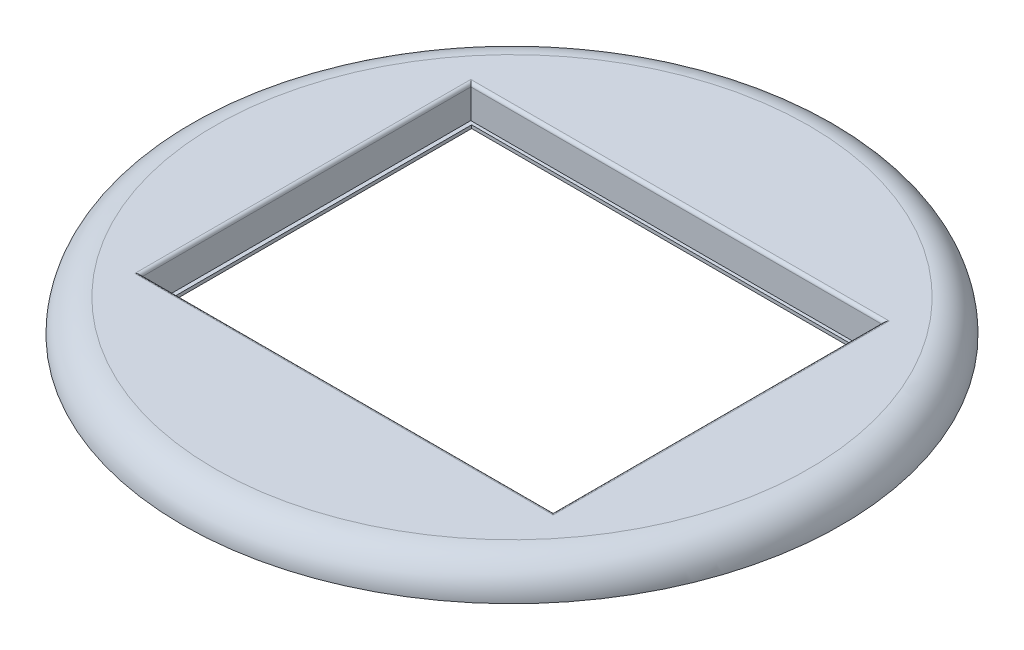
ISO-10303-21;
HEADER;
FILE_DESCRIPTION(('STEP AP214'),'2;1');
FILE_NAME('part.step','',(''),(''),'','','');
FILE_SCHEMA(('AUTOMOTIVE_DESIGN { 1 0 10303 214 1 1 1 1 }'));
ENDSEC;
DATA;
#1=APPLICATION_CONTEXT('core data for automotive mechanical design processes');
#2=APPLICATION_PROTOCOL_DEFINITION('international standard','automotive_design',2000,#1);
#3=PRODUCT_CONTEXT('',#1,'mechanical');
#4=PRODUCT('Part','Part','',(#3));
#5=PRODUCT_RELATED_PRODUCT_CATEGORY('part','',(#4));
#6=PRODUCT_DEFINITION_FORMATION('','',#4);
#7=PRODUCT_DEFINITION_CONTEXT('part definition',#1,'design');
#8=PRODUCT_DEFINITION('design','',#6,#7);
#9=PRODUCT_DEFINITION_SHAPE('','',#8);
#10=(LENGTH_UNIT() NAMED_UNIT(*) SI_UNIT(.MILLI.,.METRE.));
#11=(NAMED_UNIT(*) PLANE_ANGLE_UNIT() SI_UNIT($,.RADIAN.));
#12=(NAMED_UNIT(*) SI_UNIT($,.STERADIAN.) SOLID_ANGLE_UNIT());
#13=UNCERTAINTY_MEASURE_WITH_UNIT(LENGTH_MEASURE(1.E-05),#10,'distance_accuracy_value','');
#14=(GEOMETRIC_REPRESENTATION_CONTEXT(3) GLOBAL_UNCERTAINTY_ASSIGNED_CONTEXT((#13)) GLOBAL_UNIT_ASSIGNED_CONTEXT((#10,
#11,#12)) REPRESENTATION_CONTEXT('',''));
#15=CARTESIAN_POINT('',(0.,0.,0.));
#16=DIRECTION('',(0.,0.,1.));
#17=DIRECTION('',(1.,0.,0.));
#18=AXIS2_PLACEMENT_3D('',#15,#16,#17);
#19=CARTESIAN_POINT('',(0.,-1.,0.));
#20=DIRECTION('',(0.,-1.,0.));
#21=DIRECTION('',(0.,0.,-1.));
#22=AXIS2_PLACEMENT_3D('',#19,#20,#21);
#23=PLANE('',#22);
#24=DIRECTION('',(0.,0.,-1.));
#25=VECTOR('',#24,1.);
#26=CARTESIAN_POINT('',(-63.5,-1.,-50.8));
#27=LINE('',#26,#25);
#28=CARTESIAN_POINT('',(-63.5,-1.,50.8));
#29=VERTEX_POINT('',#28);
#30=CARTESIAN_POINT('',(-63.5,-1.,-50.8));
#31=VERTEX_POINT('',#30);
#32=EDGE_CURVE('E155',#29,#31,#27,.T.);
#33=ORIENTED_EDGE('',*,*,#32,.T.);
#34=DIRECTION('',(1.,0.,0.));
#35=VECTOR('',#34,1.);
#36=CARTESIAN_POINT('',(63.5,-1.,-50.8));
#37=LINE('',#36,#35);
#38=CARTESIAN_POINT('',(63.5,-1.,-50.8));
#39=VERTEX_POINT('',#38);
#40=EDGE_CURVE('E158',#31,#39,#37,.T.);
#41=ORIENTED_EDGE('',*,*,#40,.T.);
#42=DIRECTION('',(0.,0.,1.));
#43=VECTOR('',#42,1.);
#44=CARTESIAN_POINT('',(63.5,-1.,-50.8));
#45=LINE('',#44,#43);
#46=CARTESIAN_POINT('',(63.5,-1.,50.8));
#47=VERTEX_POINT('',#46);
#48=EDGE_CURVE('E161',#39,#47,#45,.T.);
#49=ORIENTED_EDGE('',*,*,#48,.T.);
#50=DIRECTION('',(-1.,0.,0.));
#51=VECTOR('',#50,1.);
#52=CARTESIAN_POINT('',(63.5,-1.,50.8));
#53=LINE('',#52,#51);
#54=EDGE_CURVE('E163',#47,#29,#53,.T.);
#55=ORIENTED_EDGE('',*,*,#54,.T.);
#56=EDGE_LOOP('',(#33,#41,#49,#55));
#57=FACE_BOUND('',#56,.T.);
#58=DIRECTION('',(1.,0.,0.));
#59=VECTOR('',#58,1.);
#60=CARTESIAN_POINT('',(62.25,-1.,-49.8));
#61=LINE('',#60,#59);
#62=CARTESIAN_POINT('',(-62.25,-1.,-49.8));
#63=VERTEX_POINT('',#62);
#64=CARTESIAN_POINT('',(62.25,-1.,-49.8));
#65=VERTEX_POINT('',#64);
#66=EDGE_CURVE('E127',#63,#65,#61,.T.);
#67=ORIENTED_EDGE('',*,*,#66,.F.);
#68=DIRECTION('',(0.,0.,-1.));
#69=VECTOR('',#68,1.);
#70=CARTESIAN_POINT('',(-62.25,-1.,-49.8));
#71=LINE('',#70,#69);
#72=CARTESIAN_POINT('',(-62.25,-1.,49.8));
#73=VERTEX_POINT('',#72);
#74=EDGE_CURVE('E119',#73,#63,#71,.T.);
#75=ORIENTED_EDGE('',*,*,#74,.F.);
#76=DIRECTION('',(-1.,0.,0.));
#77=VECTOR('',#76,1.);
#78=CARTESIAN_POINT('',(62.25,-1.,49.8));
#79=LINE('',#78,#77);
#80=CARTESIAN_POINT('',(62.25,-1.,49.8));
#81=VERTEX_POINT('',#80);
#82=EDGE_CURVE('E141',#81,#73,#79,.T.);
#83=ORIENTED_EDGE('',*,*,#82,.F.);
#84=DIRECTION('',(0.,0.,1.));
#85=VECTOR('',#84,1.);
#86=CARTESIAN_POINT('',(62.25,-1.,-49.8));
#87=LINE('',#86,#85);
#88=EDGE_CURVE('E139',#65,#81,#87,.T.);
#89=ORIENTED_EDGE('',*,*,#88,.F.);
#90=EDGE_LOOP('',(#67,#75,#83,#89));
#91=FACE_BOUND('',#90,.T.);
#92=ADVANCED_FACE('F54',(#57,#91),#23,.T.);
#93=CARTESIAN_POINT('',(0.,0.,0.));
#94=DIRECTION('',(0.,-1.,0.));
#95=DIRECTION('',(0.,0.,-1.));
#96=AXIS2_PLACEMENT_3D('',#93,#94,#95);
#97=PLANE('',#96);
#98=DIRECTION('',(0.,0.,-1.));
#99=VECTOR('',#98,1.);
#100=CARTESIAN_POINT('',(-63.5,0.,-50.8));
#101=LINE('',#100,#99);
#102=CARTESIAN_POINT('',(-63.5,0.,50.8));
#103=VERTEX_POINT('',#102);
#104=CARTESIAN_POINT('',(-63.5,0.,-50.8));
#105=VERTEX_POINT('',#104);
#106=EDGE_CURVE('E135',#103,#105,#101,.T.);
#107=ORIENTED_EDGE('',*,*,#106,.F.);
#108=DIRECTION('',(-1.,0.,0.));
#109=VECTOR('',#108,1.);
#110=CARTESIAN_POINT('',(63.5,0.,50.8));
#111=LINE('',#110,#109);
#112=CARTESIAN_POINT('',(63.5,0.,50.8));
#113=VERTEX_POINT('',#112);
#114=EDGE_CURVE('E159',#113,#103,#111,.T.);
#115=ORIENTED_EDGE('',*,*,#114,.F.);
#116=DIRECTION('',(0.,0.,1.));
#117=VECTOR('',#116,1.);
#118=CARTESIAN_POINT('',(63.5,0.,-50.8));
#119=LINE('',#118,#117);
#120=CARTESIAN_POINT('',(63.5,0.,-50.8));
#121=VERTEX_POINT('',#120);
#122=EDGE_CURVE('E170',#121,#113,#119,.T.);
#123=ORIENTED_EDGE('',*,*,#122,.F.);
#124=DIRECTION('',(1.,0.,0.));
#125=VECTOR('',#124,1.);
#126=CARTESIAN_POINT('',(63.5,0.,-50.8));
#127=LINE('',#126,#125);
#128=EDGE_CURVE('E168',#105,#121,#127,.T.);
#129=ORIENTED_EDGE('',*,*,#128,.F.);
#130=EDGE_LOOP('',(#107,#115,#123,#129));
#131=FACE_BOUND('',#130,.T.);
#132=DIRECTION('',(0.,0.,-1.));
#133=VECTOR('',#132,1.);
#134=CARTESIAN_POINT('',(-62.25,0.,-49.8));
#135=LINE('',#134,#133);
#136=CARTESIAN_POINT('',(-62.25,0.,49.8));
#137=VERTEX_POINT('',#136);
#138=CARTESIAN_POINT('',(-62.25,0.,-49.8));
#139=VERTEX_POINT('',#138);
#140=EDGE_CURVE('E77',#137,#139,#135,.T.);
#141=ORIENTED_EDGE('',*,*,#140,.T.);
#142=DIRECTION('',(1.,0.,0.));
#143=VECTOR('',#142,1.);
#144=CARTESIAN_POINT('',(62.25,0.,-49.8));
#145=LINE('',#144,#143);
#146=CARTESIAN_POINT('',(62.25,0.,-49.8));
#147=VERTEX_POINT('',#146);
#148=EDGE_CURVE('E134',#139,#147,#145,.T.);
#149=ORIENTED_EDGE('',*,*,#148,.T.);
#150=DIRECTION('',(0.,0.,1.));
#151=VECTOR('',#150,1.);
#152=CARTESIAN_POINT('',(62.25,0.,-49.8));
#153=LINE('',#152,#151);
#154=CARTESIAN_POINT('',(62.25,0.,49.8));
#155=VERTEX_POINT('',#154);
#156=EDGE_CURVE('E147',#147,#155,#153,.T.);
#157=ORIENTED_EDGE('',*,*,#156,.T.);
#158=DIRECTION('',(-1.,0.,0.));
#159=VECTOR('',#158,1.);
#160=CARTESIAN_POINT('',(62.25,0.,49.8));
#161=LINE('',#160,#159);
#162=EDGE_CURVE('E128',#155,#137,#161,.T.);
#163=ORIENTED_EDGE('',*,*,#162,.T.);
#164=EDGE_LOOP('',(#141,#149,#157,#163));
#165=FACE_BOUND('',#164,.T.);
#166=ADVANCED_FACE('F188',(#131,#165),#97,.F.);
#167=CARTESIAN_POINT('',(-63.5,-1.,-50.8));
#168=DIRECTION('',(1.,0.,0.));
#169=DIRECTION('',(0.,0.,-1.));
#170=AXIS2_PLACEMENT_3D('',#167,#168,#169);
#171=PLANE('',#170);
#172=ORIENTED_EDGE('',*,*,#106,.T.);
#173=DIRECTION('',(0.,1.,0.));
#174=VECTOR('',#173,1.);
#175=CARTESIAN_POINT('',(-63.5,-1.,-50.8));
#176=LINE('',#175,#174);
#177=EDGE_CURVE('E12',#31,#105,#176,.T.);
#178=ORIENTED_EDGE('',*,*,#177,.F.);
#179=ORIENTED_EDGE('',*,*,#32,.F.);
#180=DIRECTION('',(0.,1.,0.));
#181=VECTOR('',#180,1.);
#182=CARTESIAN_POINT('',(-63.5,-1.,50.8));
#183=LINE('',#182,#181);
#184=EDGE_CURVE('E165',#29,#103,#183,.T.);
#185=ORIENTED_EDGE('',*,*,#184,.T.);
#186=EDGE_LOOP('',(#172,#178,#179,#185));
#187=FACE_BOUND('',#186,.T.);
#188=ADVANCED_FACE('F56',(#187),#171,.F.);
#189=CARTESIAN_POINT('',(63.5,-1.,-50.8));
#190=DIRECTION('',(0.,0.,1.));
#191=DIRECTION('',(1.,0.,0.));
#192=AXIS2_PLACEMENT_3D('',#189,#190,#191);
#193=PLANE('',#192);
#194=ORIENTED_EDGE('',*,*,#128,.T.);
#195=DIRECTION('',(0.,1.,0.));
#196=VECTOR('',#195,1.);
#197=CARTESIAN_POINT('',(63.5,-1.,-50.8));
#198=LINE('',#197,#196);
#199=EDGE_CURVE('E62',#39,#121,#198,.T.);
#200=ORIENTED_EDGE('',*,*,#199,.F.);
#201=ORIENTED_EDGE('',*,*,#40,.F.);
#202=ORIENTED_EDGE('',*,*,#177,.T.);
#203=EDGE_LOOP('',(#194,#200,#201,#202));
#204=FACE_BOUND('',#203,.T.);
#205=ADVANCED_FACE('F198',(#204),#193,.F.);
#206=CARTESIAN_POINT('',(63.5,-1.,-50.8));
#207=DIRECTION('',(-1.,0.,0.));
#208=DIRECTION('',(0.,0.,1.));
#209=AXIS2_PLACEMENT_3D('',#206,#207,#208);
#210=PLANE('',#209);
#211=ORIENTED_EDGE('',*,*,#122,.T.);
#212=DIRECTION('',(0.,1.,0.));
#213=VECTOR('',#212,1.);
#214=CARTESIAN_POINT('',(63.5,-1.,50.8));
#215=LINE('',#214,#213);
#216=EDGE_CURVE('E175',#47,#113,#215,.T.);
#217=ORIENTED_EDGE('',*,*,#216,.F.);
#218=ORIENTED_EDGE('',*,*,#48,.F.);
#219=ORIENTED_EDGE('',*,*,#199,.T.);
#220=EDGE_LOOP('',(#211,#217,#218,#219));
#221=FACE_BOUND('',#220,.T.);
#222=ADVANCED_FACE('F182',(#221),#210,.F.);
#223=CARTESIAN_POINT('',(63.5,-1.,50.8));
#224=DIRECTION('',(0.,0.,-1.));
#225=DIRECTION('',(-1.,0.,0.));
#226=AXIS2_PLACEMENT_3D('',#223,#224,#225);
#227=PLANE('',#226);
#228=ORIENTED_EDGE('',*,*,#114,.T.);
#229=ORIENTED_EDGE('',*,*,#184,.F.);
#230=ORIENTED_EDGE('',*,*,#54,.F.);
#231=ORIENTED_EDGE('',*,*,#216,.T.);
#232=EDGE_LOOP('',(#228,#229,#230,#231));
#233=FACE_BOUND('',#232,.T.);
#234=ADVANCED_FACE('F192',(#233),#227,.F.);
#235=CARTESIAN_POINT('',(-62.25,-1.,-49.8));
#236=DIRECTION('',(1.,0.,0.));
#237=DIRECTION('',(0.,0.,-1.));
#238=AXIS2_PLACEMENT_3D('',#235,#236,#237);
#239=PLANE('',#238);
#240=ORIENTED_EDGE('',*,*,#140,.F.);
#241=DIRECTION('',(0.,1.,0.));
#242=VECTOR('',#241,1.);
#243=CARTESIAN_POINT('',(-62.25,-1.,49.8));
#244=LINE('',#243,#242);
#245=EDGE_CURVE('E123',#73,#137,#244,.T.);
#246=ORIENTED_EDGE('',*,*,#245,.F.);
#247=ORIENTED_EDGE('',*,*,#74,.T.);
#248=DIRECTION('',(0.,1.,0.));
#249=VECTOR('',#248,1.);
#250=CARTESIAN_POINT('',(-62.25,-1.,-49.8));
#251=LINE('',#250,#249);
#252=EDGE_CURVE('E122',#63,#139,#251,.T.);
#253=ORIENTED_EDGE('',*,*,#252,.T.);
#254=EDGE_LOOP('',(#240,#246,#247,#253));
#255=FACE_BOUND('',#254,.T.);
#256=ADVANCED_FACE('F121',(#255),#239,.T.);
#257=CARTESIAN_POINT('',(62.25,-1.,-49.8));
#258=DIRECTION('',(0.,0.,1.));
#259=DIRECTION('',(1.,0.,0.));
#260=AXIS2_PLACEMENT_3D('',#257,#258,#259);
#261=PLANE('',#260);
#262=ORIENTED_EDGE('',*,*,#148,.F.);
#263=ORIENTED_EDGE('',*,*,#252,.F.);
#264=ORIENTED_EDGE('',*,*,#66,.T.);
#265=DIRECTION('',(0.,1.,0.));
#266=VECTOR('',#265,1.);
#267=CARTESIAN_POINT('',(62.25,-1.,-49.8));
#268=LINE('',#267,#266);
#269=EDGE_CURVE('E136',#65,#147,#268,.T.);
#270=ORIENTED_EDGE('',*,*,#269,.T.);
#271=EDGE_LOOP('',(#262,#263,#264,#270));
#272=FACE_BOUND('',#271,.T.);
#273=ADVANCED_FACE('F131',(#272),#261,.T.);
#274=CARTESIAN_POINT('',(62.25,-1.,-49.8));
#275=DIRECTION('',(-1.,0.,0.));
#276=DIRECTION('',(0.,0.,1.));
#277=AXIS2_PLACEMENT_3D('',#274,#275,#276);
#278=PLANE('',#277);
#279=ORIENTED_EDGE('',*,*,#156,.F.);
#280=ORIENTED_EDGE('',*,*,#269,.F.);
#281=ORIENTED_EDGE('',*,*,#88,.T.);
#282=DIRECTION('',(0.,1.,0.));
#283=VECTOR('',#282,1.);
#284=CARTESIAN_POINT('',(62.25,-1.,49.8));
#285=LINE('',#284,#283);
#286=EDGE_CURVE('E69',#81,#155,#285,.T.);
#287=ORIENTED_EDGE('',*,*,#286,.T.);
#288=EDGE_LOOP('',(#279,#280,#281,#287));
#289=FACE_BOUND('',#288,.T.);
#290=ADVANCED_FACE('F221',(#289),#278,.T.);
#291=CARTESIAN_POINT('',(62.25,-1.,49.8));
#292=DIRECTION('',(0.,0.,-1.));
#293=DIRECTION('',(-1.,0.,0.));
#294=AXIS2_PLACEMENT_3D('',#291,#292,#293);
#295=PLANE('',#294);
#296=ORIENTED_EDGE('',*,*,#162,.F.);
#297=ORIENTED_EDGE('',*,*,#286,.F.);
#298=ORIENTED_EDGE('',*,*,#82,.T.);
#299=ORIENTED_EDGE('',*,*,#245,.T.);
#300=EDGE_LOOP('',(#296,#297,#298,#299));
#301=FACE_BOUND('',#300,.T.);
#302=ADVANCED_FACE('F225',(#301),#295,.T.);
#303=CLOSED_SHELL('',(#92,#166,#188,#205,#222,#234,#256,#273,#290,#302));
#304=MANIFOLD_SOLID_BREP('B2',#303);
#305=CARTESIAN_POINT('',(0.,10.,0.));
#306=DIRECTION('',(0.,1.,0.));
#307=DIRECTION('',(0.,0.,1.));
#308=AXIS2_PLACEMENT_3D('',#305,#306,#307);
#309=PLANE('',#308);
#310=DIRECTION('',(-1.,0.,0.));
#311=VECTOR('',#310,1.);
#312=CARTESIAN_POINT('',(0.,10.,-51.8));
#313=LINE('',#312,#311);
#314=CARTESIAN_POINT('',(-64.5,10.,-51.8));
#315=VERTEX_POINT('',#314);
#316=CARTESIAN_POINT('',(64.5,10.,-51.8));
#317=VERTEX_POINT('',#316);
#318=EDGE_CURVE('E396',#315,#317,#313,.F.);
#319=ORIENTED_EDGE('',*,*,#318,.T.);
#320=DIRECTION('',(0.,0.,-1.));
#321=VECTOR('',#320,1.);
#322=CARTESIAN_POINT('',(64.5,10.,0.));
#323=LINE('',#322,#321);
#324=CARTESIAN_POINT('',(64.5,10.,51.8));
#325=VERTEX_POINT('',#324);
#326=EDGE_CURVE('E399',#317,#325,#323,.F.);
#327=ORIENTED_EDGE('',*,*,#326,.T.);
#328=DIRECTION('',(1.,0.,0.));
#329=VECTOR('',#328,1.);
#330=CARTESIAN_POINT('',(0.,10.,51.8));
#331=LINE('',#330,#329);
#332=CARTESIAN_POINT('',(-64.5,10.,51.8));
#333=VERTEX_POINT('',#332);
#334=EDGE_CURVE('E393',#325,#333,#331,.F.);
#335=ORIENTED_EDGE('',*,*,#334,.T.);
#336=DIRECTION('',(0.,0.,1.));
#337=VECTOR('',#336,1.);
#338=CARTESIAN_POINT('',(-64.5,10.,0.));
#339=LINE('',#338,#337);
#340=EDGE_CURVE('E390',#333,#315,#339,.F.);
#341=ORIENTED_EDGE('',*,*,#340,.T.);
#342=EDGE_LOOP('',(#319,#327,#335,#341));
#343=FACE_BOUND('',#342,.T.);
#344=CARTESIAN_POINT('',(0.,10.,0.));
#345=DIRECTION('',(0.,1.,0.));
#346=DIRECTION('',(0.,0.,1.));
#347=AXIS2_PLACEMENT_3D('',#344,#345,#346);
#348=CIRCLE('',#347,91.6);
#349=CARTESIAN_POINT('',(0.,10.,91.6));
#350=VERTEX_POINT('',#349);
#351=EDGE_CURVE('E382',#350,#350,#348,.T.);
#352=ORIENTED_EDGE('',*,*,#351,.T.);
#353=EDGE_LOOP('',(#352));
#354=FACE_BOUND('',#353,.T.);
#355=ADVANCED_FACE('F283',(#343,#354),#309,.T.);
#356=CARTESIAN_POINT('',(0.,0.,0.));
#357=DIRECTION('',(0.,1.,0.));
#358=DIRECTION('',(0.,0.,1.));
#359=AXIS2_PLACEMENT_3D('',#356,#357,#358);
#360=PLANE('',#359);
#361=CARTESIAN_POINT('',(0.,0.,0.));
#362=DIRECTION('',(0.,1.,0.));
#363=DIRECTION('',(0.,0.,1.));
#364=AXIS2_PLACEMENT_3D('',#361,#362,#363);
#365=CIRCLE('',#364,101.6);
#366=CARTESIAN_POINT('',(0.,0.,101.6));
#367=VERTEX_POINT('',#366);
#368=EDGE_CURVE('E345',#367,#367,#365,.T.);
#369=ORIENTED_EDGE('',*,*,#368,.F.);
#370=EDGE_LOOP('',(#369));
#371=FACE_BOUND('',#370,.T.);
#372=DIRECTION('',(0.,0.,1.));
#373=VECTOR('',#372,1.);
#374=CARTESIAN_POINT('',(-63.5,0.,50.8));
#375=LINE('',#374,#373);
#376=CARTESIAN_POINT('',(-63.5,0.,-50.8));
#377=VERTEX_POINT('',#376);
#378=CARTESIAN_POINT('',(-63.5,0.,50.8));
#379=VERTEX_POINT('',#378);
#380=EDGE_CURVE('E340',#377,#379,#375,.T.);
#381=ORIENTED_EDGE('',*,*,#380,.T.);
#382=DIRECTION('',(1.,0.,0.));
#383=VECTOR('',#382,1.);
#384=CARTESIAN_POINT('',(63.5,0.,50.8));
#385=LINE('',#384,#383);
#386=CARTESIAN_POINT('',(63.5,0.,50.8));
#387=VERTEX_POINT('',#386);
#388=EDGE_CURVE('E349',#379,#387,#385,.T.);
#389=ORIENTED_EDGE('',*,*,#388,.T.);
#390=DIRECTION('',(0.,0.,-1.));
#391=VECTOR('',#390,1.);
#392=CARTESIAN_POINT('',(63.5,0.,50.8));
#393=LINE('',#392,#391);
#394=CARTESIAN_POINT('',(63.5,0.,-50.8));
#395=VERTEX_POINT('',#394);
#396=EDGE_CURVE('E356',#387,#395,#393,.T.);
#397=ORIENTED_EDGE('',*,*,#396,.T.);
#398=DIRECTION('',(-1.,0.,0.));
#399=VECTOR('',#398,1.);
#400=CARTESIAN_POINT('',(63.5,0.,-50.8));
#401=LINE('',#400,#399);
#402=EDGE_CURVE('E360',#395,#377,#401,.T.);
#403=ORIENTED_EDGE('',*,*,#402,.T.);
#404=EDGE_LOOP('',(#381,#389,#397,#403));
#405=FACE_BOUND('',#404,.T.);
#406=ADVANCED_FACE('F358',(#371,#405),#360,.F.);
#407=CARTESIAN_POINT('',(-63.5,10.,50.8));
#408=DIRECTION('',(1.,0.,0.));
#409=DIRECTION('',(0.,0.,-1.));
#410=AXIS2_PLACEMENT_3D('',#407,#408,#409);
#411=PLANE('',#410);
#412=DIRECTION('',(0.,-1.,0.));
#413=VECTOR('',#412,1.);
#414=CARTESIAN_POINT('',(-63.5,10.,-50.8));
#415=LINE('',#414,#413);
#416=CARTESIAN_POINT('',(-63.5,9.,-50.8));
#417=VERTEX_POINT('',#416);
#418=EDGE_CURVE('E371',#417,#377,#415,.T.);
#419=ORIENTED_EDGE('',*,*,#418,.F.);
#420=DIRECTION('',(0.,0.,1.));
#421=VECTOR('',#420,1.);
#422=CARTESIAN_POINT('',(-63.5,9.,50.8));
#423=LINE('',#422,#421);
#424=CARTESIAN_POINT('',(-63.5,9.,50.8));
#425=VERTEX_POINT('',#424);
#426=EDGE_CURVE('E52',#417,#425,#423,.T.);
#427=ORIENTED_EDGE('',*,*,#426,.T.);
#428=DIRECTION('',(0.,-1.,0.));
#429=VECTOR('',#428,1.);
#430=CARTESIAN_POINT('',(-63.5,10.,50.8));
#431=LINE('',#430,#429);
#432=EDGE_CURVE('E336',#425,#379,#431,.T.);
#433=ORIENTED_EDGE('',*,*,#432,.T.);
#434=ORIENTED_EDGE('',*,*,#380,.F.);
#435=EDGE_LOOP('',(#419,#427,#433,#434));
#436=FACE_BOUND('',#435,.T.);
#437=ADVANCED_FACE('F338',(#436),#411,.T.);
#438=CARTESIAN_POINT('',(63.5,10.,50.8));
#439=DIRECTION('',(0.,0.,-1.));
#440=DIRECTION('',(-1.,0.,0.));
#441=AXIS2_PLACEMENT_3D('',#438,#439,#440);
#442=PLANE('',#441);
#443=ORIENTED_EDGE('',*,*,#432,.F.);
#444=DIRECTION('',(1.,0.,0.));
#445=VECTOR('',#444,1.);
#446=CARTESIAN_POINT('',(63.5,9.,50.8));
#447=LINE('',#446,#445);
#448=CARTESIAN_POINT('',(63.5,9.,50.8));
#449=VERTEX_POINT('',#448);
#450=EDGE_CURVE('E293',#425,#449,#447,.T.);
#451=ORIENTED_EDGE('',*,*,#450,.T.);
#452=DIRECTION('',(0.,-1.,0.));
#453=VECTOR('',#452,1.);
#454=CARTESIAN_POINT('',(63.5,10.,50.8));
#455=LINE('',#454,#453);
#456=EDGE_CURVE('E346',#449,#387,#455,.T.);
#457=ORIENTED_EDGE('',*,*,#456,.T.);
#458=ORIENTED_EDGE('',*,*,#388,.F.);
#459=EDGE_LOOP('',(#443,#451,#457,#458));
#460=FACE_BOUND('',#459,.T.);
#461=ADVANCED_FACE('F350',(#460),#442,.T.);
#462=CARTESIAN_POINT('',(63.5,10.,50.8));
#463=DIRECTION('',(-1.,0.,0.));
#464=DIRECTION('',(0.,0.,1.));
#465=AXIS2_PLACEMENT_3D('',#462,#463,#464);
#466=PLANE('',#465);
#467=ORIENTED_EDGE('',*,*,#456,.F.);
#468=DIRECTION('',(0.,0.,-1.));
#469=VECTOR('',#468,1.);
#470=CARTESIAN_POINT('',(63.5,9.,50.8));
#471=LINE('',#470,#469);
#472=CARTESIAN_POINT('',(63.5,9.,-50.8));
#473=VERTEX_POINT('',#472);
#474=EDGE_CURVE('E386',#449,#473,#471,.T.);
#475=ORIENTED_EDGE('',*,*,#474,.T.);
#476=DIRECTION('',(0.,-1.,0.));
#477=VECTOR('',#476,1.);
#478=CARTESIAN_POINT('',(63.5,10.,-50.8));
#479=LINE('',#478,#477);
#480=EDGE_CURVE('E374',#473,#395,#479,.T.);
#481=ORIENTED_EDGE('',*,*,#480,.T.);
#482=ORIENTED_EDGE('',*,*,#396,.F.);
#483=EDGE_LOOP('',(#467,#475,#481,#482));
#484=FACE_BOUND('',#483,.T.);
#485=ADVANCED_FACE('F428',(#484),#466,.T.);
#486=CARTESIAN_POINT('',(63.5,10.,-50.8));
#487=DIRECTION('',(0.,0.,1.));
#488=DIRECTION('',(1.,0.,0.));
#489=AXIS2_PLACEMENT_3D('',#486,#487,#488);
#490=PLANE('',#489);
#491=ORIENTED_EDGE('',*,*,#480,.F.);
#492=DIRECTION('',(-1.,0.,0.));
#493=VECTOR('',#492,1.);
#494=CARTESIAN_POINT('',(63.5,9.,-50.8));
#495=LINE('',#494,#493);
#496=EDGE_CURVE('E307',#473,#417,#495,.T.);
#497=ORIENTED_EDGE('',*,*,#496,.T.);
#498=ORIENTED_EDGE('',*,*,#418,.T.);
#499=ORIENTED_EDGE('',*,*,#402,.F.);
#500=EDGE_LOOP('',(#491,#497,#498,#499));
#501=FACE_BOUND('',#500,.T.);
#502=ADVANCED_FACE('F429',(#501),#490,.T.);
#503=CARTESIAN_POINT('',(0.,0.,0.));
#504=DIRECTION('',(0.,1.,0.));
#505=DIRECTION('',(0.,0.,1.));
#506=AXIS2_PLACEMENT_3D('',#503,#504,#505);
#507=TOROIDAL_SURFACE('',#506,91.6,10.);
#508=ORIENTED_EDGE('',*,*,#368,.T.);
#509=EDGE_LOOP('',(#508));
#510=FACE_BOUND('',#509,.T.);
#511=ORIENTED_EDGE('',*,*,#351,.F.);
#512=EDGE_LOOP('',(#511));
#513=FACE_BOUND('',#512,.T.);
#514=ADVANCED_FACE('F431',(#510,#513),#507,.T.);
#515=CARTESIAN_POINT('',(-64.5,9.,50.8));
#516=DIRECTION('',(0.,0.,1.));
#517=DIRECTION('',(1.,0.,0.));
#518=AXIS2_PLACEMENT_3D('',#515,#516,#517);
#519=CYLINDRICAL_SURFACE('',#518,1.);
#520=CARTESIAN_POINT('',(-64.5,9.,-51.8));
#521=DIRECTION('',(-0.707106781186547,0.,0.707106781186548));
#522=DIRECTION('',(-0.707106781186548,0.,-0.707106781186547));
#523=AXIS2_PLACEMENT_3D('',#520,#521,#522);
#524=ELLIPSE('',#523,1.41421356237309,1.);
#525=EDGE_CURVE('E365',#315,#417,#524,.F.);
#526=ORIENTED_EDGE('',*,*,#525,.F.);
#527=ORIENTED_EDGE('',*,*,#340,.F.);
#528=CARTESIAN_POINT('',(-64.5,9.,51.8));
#529=DIRECTION('',(0.707106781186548,0.,0.707106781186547));
#530=DIRECTION('',(0.707106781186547,0.,-0.707106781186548));
#531=AXIS2_PLACEMENT_3D('',#528,#529,#530);
#532=ELLIPSE('',#531,1.4142135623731,1.);
#533=EDGE_CURVE('E287',#425,#333,#532,.T.);
#534=ORIENTED_EDGE('',*,*,#533,.F.);
#535=ORIENTED_EDGE('',*,*,#426,.F.);
#536=EDGE_LOOP('',(#526,#527,#534,#535));
#537=FACE_BOUND('',#536,.T.);
#538=ADVANCED_FACE('F285',(#537),#519,.T.);
#539=CARTESIAN_POINT('',(63.5,9.,51.8));
#540=DIRECTION('',(1.,0.,0.));
#541=DIRECTION('',(0.,0.,-1.));
#542=AXIS2_PLACEMENT_3D('',#539,#540,#541);
#543=CYLINDRICAL_SURFACE('',#542,1.);
#544=ORIENTED_EDGE('',*,*,#533,.T.);
#545=ORIENTED_EDGE('',*,*,#334,.F.);
#546=CARTESIAN_POINT('',(64.5,9.,51.8));
#547=DIRECTION('',(0.707106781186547,0.,-0.707106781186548));
#548=DIRECTION('',(-0.707106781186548,0.,-0.707106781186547));
#549=AXIS2_PLACEMENT_3D('',#546,#547,#548);
#550=ELLIPSE('',#549,1.41421356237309,1.);
#551=EDGE_CURVE('E410',#449,#325,#550,.T.);
#552=ORIENTED_EDGE('',*,*,#551,.F.);
#553=ORIENTED_EDGE('',*,*,#450,.F.);
#554=EDGE_LOOP('',(#544,#545,#552,#553));
#555=FACE_BOUND('',#554,.T.);
#556=ADVANCED_FACE('F425',(#555),#543,.T.);
#557=CARTESIAN_POINT('',(63.5,9.,-51.8));
#558=DIRECTION('',(-1.,0.,0.));
#559=DIRECTION('',(0.,0.,1.));
#560=AXIS2_PLACEMENT_3D('',#557,#558,#559);
#561=CYLINDRICAL_SURFACE('',#560,1.);
#562=ORIENTED_EDGE('',*,*,#525,.T.);
#563=ORIENTED_EDGE('',*,*,#496,.F.);
#564=CARTESIAN_POINT('',(64.5,9.,-51.8));
#565=DIRECTION('',(-0.707106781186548,0.,-0.707106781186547));
#566=DIRECTION('',(0.707106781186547,0.,-0.707106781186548));
#567=AXIS2_PLACEMENT_3D('',#564,#565,#566);
#568=ELLIPSE('',#567,1.4142135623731,1.);
#569=EDGE_CURVE('E407',#317,#473,#568,.F.);
#570=ORIENTED_EDGE('',*,*,#569,.F.);
#571=ORIENTED_EDGE('',*,*,#318,.F.);
#572=EDGE_LOOP('',(#562,#563,#570,#571));
#573=FACE_BOUND('',#572,.T.);
#574=ADVANCED_FACE('F417',(#573),#561,.T.);
#575=CARTESIAN_POINT('',(64.5,9.,50.8));
#576=DIRECTION('',(0.,0.,-1.));
#577=DIRECTION('',(-1.,0.,0.));
#578=AXIS2_PLACEMENT_3D('',#575,#576,#577);
#579=CYLINDRICAL_SURFACE('',#578,1.);
#580=ORIENTED_EDGE('',*,*,#551,.T.);
#581=ORIENTED_EDGE('',*,*,#326,.F.);
#582=ORIENTED_EDGE('',*,*,#569,.T.);
#583=ORIENTED_EDGE('',*,*,#474,.F.);
#584=EDGE_LOOP('',(#580,#581,#582,#583));
#585=FACE_BOUND('',#584,.T.);
#586=ADVANCED_FACE('F454',(#585),#579,.T.);
#587=CLOSED_SHELL('',(#355,#406,#437,#461,#485,#502,#514,#538,#556,#574,#586));
#588=MANIFOLD_SOLID_BREP('B6',#587);
#589=ADVANCED_BREP_SHAPE_REPRESENTATION('',(#18,#304,#588),#14);
#590=SHAPE_DEFINITION_REPRESENTATION(#9,#589);
ENDSEC;
END-ISO-10303-21;
